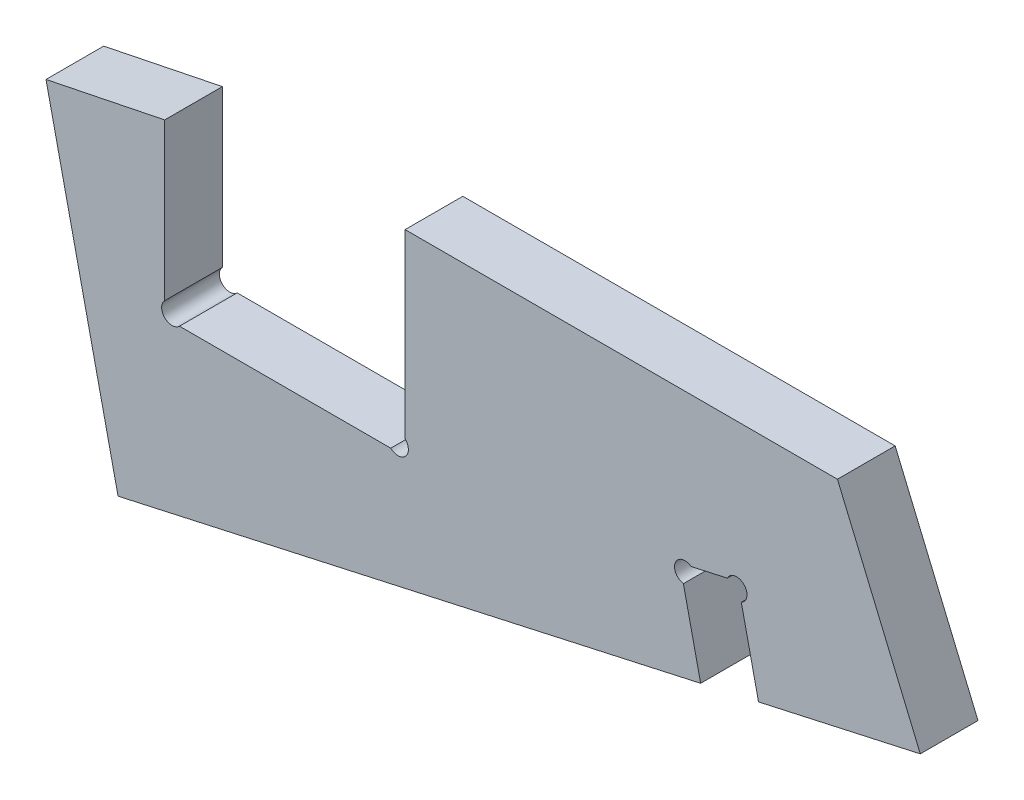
from build123d import *

# Parameters (mm, degrees)
BOSS_EXTRU_1_DEPTH      = 18
ENL_V_MAT_EXTRU_1_DEPTH = 18


with BuildPart() as part:
    # Esquisse1 → Boss.-Extru.1 (new body)
    with BuildSketch(Plane.XY):
        with BuildLine():
            Line((-72, -546.58748464), (-72, -595.424513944))
            ThreePointArc((-72, -595.424513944), (-71.979338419, -600.020661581), (-67.383190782, -600))
            Line((-67.383190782, -600), (-1.47179297, -600))
            ThreePointArc((-1.47179297, -600), (3.122761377, -599.877238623), (3, -595.282684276))
            Line((3, -595.282684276), (3, -538.717583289))
            Line((3, -538.717583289), (25.332799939, -538.717583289))
            Line((25.332799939, -538.717583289), (137.858390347, -538.717583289))
            Line((137.858390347, -538.717583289), (163.699716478, -600))
            Line((163.699716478, -600), (-86.54088752, -655.502325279))
            Line((-86.54088752, -655.502325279), (-109.018382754, -554.159148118))
            Line((-109.018382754, -554.159148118), (-72, -546.58748464))
        make_face()
    extrude(amount=BOSS_EXTRU_1_DEPTH)

    # Esquisse2 → Enl_v. mat.-Extru.1 (cut)
    with BuildSketch(Plane.XY.offset(18)):
        with BuildLine():
            Line((113.241167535, -611.191496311), (107.864875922, -586.951674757))
            ThreePointArc((107.864875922, -586.951674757), (108.666931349, -581.738531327), (103.468336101, -582.630027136))
            Line((103.468336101, -582.630027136), (92.222129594, -585.12438897))
            ThreePointArc((92.222129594, -585.12438897), (87.29881293, -586.501138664), (89.80378602, -590.957549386))
            Line((89.80378602, -590.957549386), (95.180077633, -615.19737094))
            Line((95.180077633, -615.19737094), (113.241167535, -611.191496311))
        make_face()
    extrude(amount=-ENL_V_MAT_EXTRU_1_DEPTH, mode=Mode.SUBTRACT)


solid = part.part
